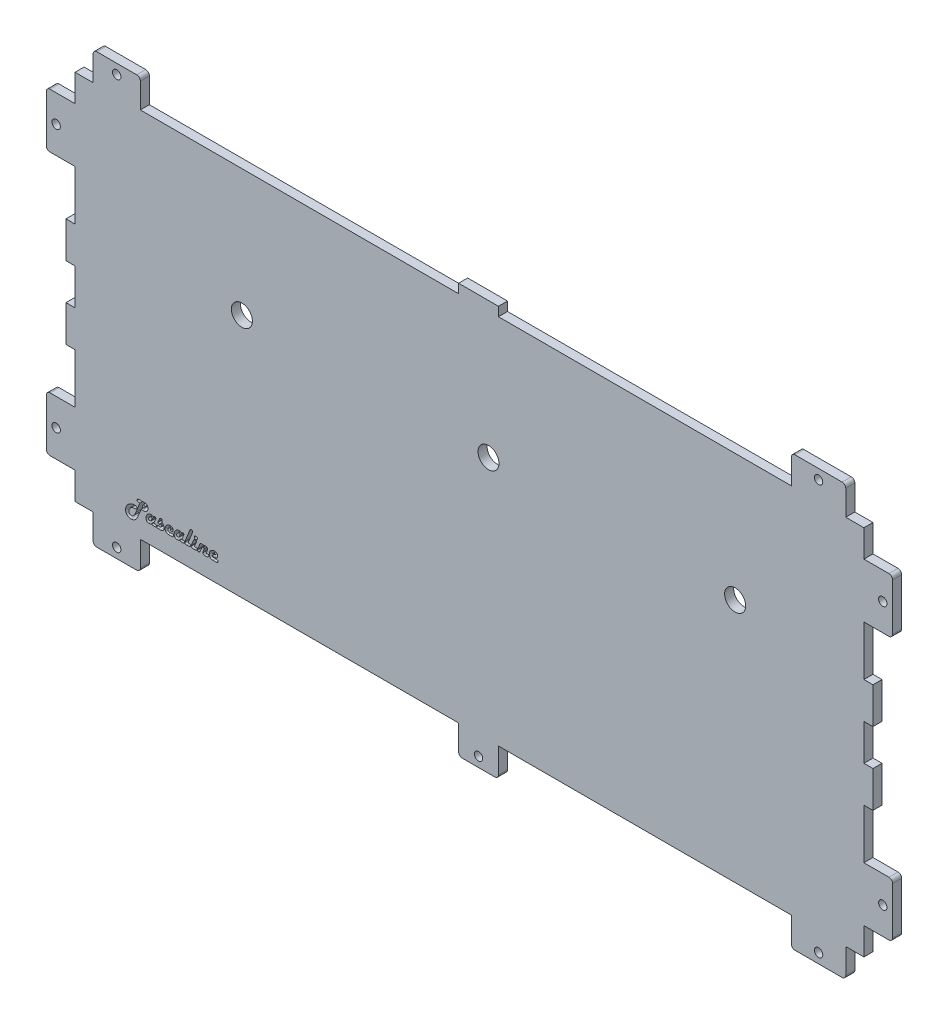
from build123d import *

# Parameters (mm, degrees)
SKETCH1_W             = 276.225
SKETCH1_H             = 130.175
SKETCH1_R             = 3.683
BOSS_EXTRUDE1_DEPTH   = 3.175
SKETCH2_W             = 10.033
SKETCH2_H             = 19.05
SKETCH2_W_2           = 3.175
SKETCH2_H_2           = 12.7
SKETCH2_W_3           = 16.51
SKETCH2_H_3           = 10.033
SKETCH2_W_4           = 13.97
SKETCH2_W_5           = 19.05
SKETCH2_H_4           = 3.175
BOSS_EXTRUDE2_DEPTH   = 3.175
F_4_CLEARANCE_HOLE1_D = 2.9464
FILLET1_R             = 1.27
CUT_EXTRUDE1_DEPTH    = 319.76638225


with BuildPart() as part:
    # Sketch1 → Boss-Extrude1 (new body)
    with BuildSketch(Plane.XY):
        with Locations((138.1125, 65.0875)):
            Rectangle(SKETCH1_W, SKETCH1_H)
        with Locations((58.42, 85.725)):
            Circle(SKETCH1_R, mode=Mode.SUBTRACT)
        with Locations((231.14, 85.725)):
            Circle(SKETCH1_R, mode=Mode.SUBTRACT)
        with Locations(Location((144.78, 85.725, 0), (0, 0, 180))):
            Circle(SKETCH1_R, mode=Mode.SUBTRACT)
    extrude(amount=BOSS_EXTRUDE1_DEPTH)

    # Sketch2 → Boss-Extrude2 (add)
    with BuildSketch(Plane.XY):
        with Locations((281.2415, 19.05)):
            Rectangle(SKETCH2_W, SKETCH2_H)
        with Locations((281.2415, 111.125)):
            Rectangle(SKETCH2_W, SKETCH2_H)
        with Locations((-1.5875, 77.7875)):
            Rectangle(SKETCH2_W_2, SKETCH2_H_2)
        with Locations((277.8125, 77.7875)):
            Rectangle(SKETCH2_W_2, SKETCH2_H_2)
        with Locations((-5.0165, 19.05)):
            Rectangle(SKETCH2_W, SKETCH2_H)
        with Locations((-5.0165, 111.125)):
            Rectangle(SKETCH2_W, SKETCH2_H)
        with Locations((277.8125, 52.3875)):
            Rectangle(SKETCH2_W_2, SKETCH2_H_2)
        with Locations((14.605, -5.0165)):
            Rectangle(SKETCH2_W_3, SKETCH2_H_3)
        with Locations((141.2875, -5.0165)):
            Rectangle(SKETCH2_W_4, SKETCH2_H_3)
        with Locations((260.35, -5.0165)):
            Rectangle(SKETCH2_W_5, SKETCH2_H_3)
        with Locations((14.605, 135.1915)):
            Rectangle(SKETCH2_W_3, SKETCH2_H_3)
        with Locations((260.35, 135.1915)):
            Rectangle(SKETCH2_W_5, SKETCH2_H_3)
        with Locations((141.2875, 131.7625)):
            Rectangle(SKETCH2_W_4, SKETCH2_H_4)
        with Locations((-1.5875, 52.3875)):
            Rectangle(SKETCH2_W_2, SKETCH2_H_2)
    extrude(amount=BOSS_EXTRUDE2_DEPTH)

    # 4 Clearance Hole1 (through all)
    with Locations(Plane.XY.offset(3.175)):
        with Locations((14.605, -6.604), (141.2875, -6.604), (260.35, -6.604), (282.829, 111.125), (-6.604, 111.125), (260.35, 136.779), (14.605, 136.779), (282.829, 19.05), (-6.604, 19.05)):
            Hole(F_4_CLEARANCE_HOLE1_D / 2)

    # Fillet1
    fillet1_edges = [part.edges().sort_by_distance(p)[0] for p in [
        (22.86, -10.033, 1.5875),
        (134.3025, -10.033, 1.5875),
        (148.2725, -10.033, 1.5875),
        (250.825, -10.033, 1.5875),
        (269.875, -10.033, 1.5875),
        (286.258, 9.525, 1.5875),
        (286.258, 28.575, 1.5875),
        (286.258, 101.6, 1.5875),
        (286.258, 120.65, 1.5875),
        (269.875, 140.208, 1.5875),
        (250.825, 140.208, 1.5875),
        (22.86, 140.208, 1.5875),
        (6.35, 140.208, 1.5875),
        (-10.033, 120.65, 1.5875),
        (-10.033, 101.6, 1.5875),
        (-10.033, 28.575, 1.5875),
        (-10.033, 9.525, 1.5875),
        (6.35, -10.033, 1.5875),
    ]]
    fillet(fillet1_edges, radius=FILLET1_R)

    # Sketch5 → Cut-Extrude1 (cut, through all)
    # profile 1 of 10: a face of its own
    with BuildSketch(Plane.XY.offset(3.175)):
        with BuildLine():
            Line((23.119201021, 9.164609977), (22.451206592, 7.500566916))
            add(Edge.make_bspline(
                [(22.451206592, 7.500566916), (22.411003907, 7.401430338), (22.333829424, 7.211124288), (22.219435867, 6.938643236), (22.112680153, 6.690113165), (22.012786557, 6.465475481), (21.920717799, 6.264069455), (21.833533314, 6.087517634), (21.755963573, 5.933870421), (21.661354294, 5.762755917), (21.539114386, 5.572432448), (21.375027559, 5.364837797), (21.194459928, 5.172753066), (21.060129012, 5.059889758), (20.992791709, 5.003313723)],
                knots=[0, 0, 0, 0, 1.315970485, 2.526183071, 3.635244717, 4.643279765, 5.550454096, 6.359128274, 7.065363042, 7.667512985, 8.763908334, 9.843272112, 10.918877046, 12, 12, 12, 12], degree=3))
            add(Edge.make_bspline(
                [(20.992791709, 5.003313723), (20.941866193, 4.965231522), (20.841070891, 4.889856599), (20.680401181, 4.792052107), (20.514563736, 4.708473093), (20.341573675, 4.641675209), (20.163005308, 4.589417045), (19.978244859, 4.551262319), (19.787353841, 4.528037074), (19.658056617, 4.52556047), (19.592618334, 4.524307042)],
                knots=[0, 0, 0, 0, 1.011044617, 2.001129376, 2.987597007, 3.961339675, 4.946518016, 5.943976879, 6.959431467, 8, 8, 8, 8], degree=3))
            add(Edge.make_bspline(
                [(19.592618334, 4.524307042), (19.523985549, 4.52577862), (19.389812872, 4.52865546), (19.193870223, 4.554855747), (19.007122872, 4.594062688), (18.83078106, 4.653339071), (18.663334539, 4.726507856), (18.506601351, 4.817898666), (18.35966799, 4.925082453), (18.22480845, 5.048815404), (18.102569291, 5.184697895), (17.996369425, 5.332046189), (17.904994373, 5.488467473), (17.831448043, 5.655681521), (17.774055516, 5.832504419), (17.734367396, 6.018966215), (17.708307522, 6.214954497), (17.70541107, 6.3491208), (17.70392946, 6.417750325)],
                knots=[0, 0, 0, 0, 1.095039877, 2.140732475, 3.150521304, 4.13652018, 5.104897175, 6.062745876, 7.026672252, 8.00261995, 8.979018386, 9.939223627, 10.897072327, 11.865449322, 12.849478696, 13.859267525, 14.904960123, 16, 16, 16, 16], degree=3))
            add(Edge.make_bspline(
                [(17.70392946, 6.417750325), (17.706469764, 6.510196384), (17.711485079, 6.692712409), (17.750571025, 6.961954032), (17.814671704, 7.222484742), (17.905671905, 7.473969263), (18.021297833, 7.716830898), (18.16431112, 7.949570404), (18.332042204, 8.17426002), (18.460931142, 8.313119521), (18.526442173, 8.383698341)],
                knots=[0, 0, 0, 0, 1.01377589, 2.001495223, 2.977585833, 3.952291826, 4.930103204, 5.92294397, 6.944284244, 8, 8, 8, 8], degree=3))
            add(Edge.make_bspline(
                [(18.526442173, 8.383698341), (18.564038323, 8.421013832), (18.639923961, 8.496332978), (18.762383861, 8.601213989), (18.891389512, 8.701406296), (19.026342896, 8.796968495), (19.169837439, 8.884085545), (19.318539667, 8.968473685), (19.475608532, 9.044630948), (19.690708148, 9.141268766), (19.965425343, 9.241006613), (20.2978387, 9.328678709), (20.629749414, 9.381793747), (20.850767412, 9.389158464), (20.96069945, 9.392821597)],
                knots=[0, 0, 0, 0, 0.706155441, 1.425333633, 2.148189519, 2.883981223, 3.628821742, 4.385725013, 5.163077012, 5.955384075, 7.529784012, 9.053423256, 10.534403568, 12, 12, 12, 12], degree=3))
            add(Edge.make_bspline(
                [(20.96069945, 9.392821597), (21.010777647, 9.391629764), (21.10661754, 9.389348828), (21.242284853, 9.36101028), (21.363435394, 9.317754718), (21.467338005, 9.255678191), (21.552788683, 9.180085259), (21.616087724, 9.091135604), (21.653226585, 8.989078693), (21.657440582, 8.917283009), (21.659597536, 8.880534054)],
                knots=[0, 0, 0, 0, 1.238826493, 2.370872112, 3.417595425, 4.41258701, 5.350953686, 6.225146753, 7.091533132, 8, 8, 8, 8], degree=3))
            add(Edge.make_bspline(
                [(21.659597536, 8.880534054), (21.657158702, 8.841764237), (21.65240403, 8.766179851), (21.612518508, 8.658791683), (21.545055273, 8.564566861), (21.48423124, 8.515858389), (21.452780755, 8.490672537)],
                knots=[0, 0, 0, 0, 1.010937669, 1.970891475, 2.950802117, 4, 4, 4, 4], degree=3))
            add(Edge.make_bspline(
                [(21.452780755, 8.490672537), (21.428650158, 8.476261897), (21.374303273, 8.443806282), (21.271172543, 8.413087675), (21.142728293, 8.387298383), (21.04721528, 8.377274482), (20.995168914, 8.371812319)],
                knots=[0, 0, 0, 0, 0.704559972, 1.586808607, 2.68501851, 4, 4, 4, 4], degree=3))
            add(Edge.make_bspline(
                [(20.995168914, 8.371812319), (20.930899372, 8.36533971), (20.80556437, 8.352717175), (20.622961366, 8.323144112), (20.44919412, 8.289935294), (20.285218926, 8.246571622), (20.130183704, 8.19766871), (19.983692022, 8.144126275), (19.847574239, 8.080489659), (19.761927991, 8.032764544), (19.719798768, 8.009288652)],
                knots=[0, 0, 0, 0, 1.159710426, 2.261604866, 3.320677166, 4.335395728, 5.305245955, 6.239579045, 7.134052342, 8, 8, 8, 8], degree=3))
            add(Edge.make_bspline(
                [(19.719798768, 8.009288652), (19.654419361, 7.967339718), (19.52562533, 7.884702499), (19.354426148, 7.733222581), (19.203332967, 7.564964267), (19.075629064, 7.379109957), (18.973627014, 7.181271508), (18.89879096, 6.976254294), (18.852926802, 6.765270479), (18.847636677, 6.622412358), (18.844987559, 6.550873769)],
                knots=[0, 0, 0, 0, 1.047576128, 2.063670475, 3.075290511, 4.094745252, 5.099666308, 6.072755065, 7.034899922, 8, 8, 8, 8], degree=3))
            add(Edge.make_bspline(
                [(18.844987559, 6.550873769), (18.845636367, 6.515185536), (18.846908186, 6.445228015), (18.857899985, 6.343133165), (18.875018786, 6.246246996), (18.901788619, 6.15588907), (18.933862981, 6.070634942), (18.972695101, 5.990387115), (19.020918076, 5.917086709), (19.073977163, 5.848438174), (19.13513267, 5.788442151), (19.199905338, 5.73415304), (19.271326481, 5.690354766), (19.346543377, 5.652700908), (19.427352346, 5.624580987), (19.513023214, 5.604540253), (19.603256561, 5.590584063), (19.665464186, 5.589730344), (19.697215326, 5.589294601)],
                knots=[0, 0, 0, 0, 1.180906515, 2.314860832, 3.395146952, 4.432720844, 5.428859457, 6.408284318, 7.375873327, 8.328235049, 9.274073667, 10.205991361, 11.119268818, 12.040047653, 12.985704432, 13.943108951, 14.9501506, 16, 16, 16, 16], degree=3))
            add(Edge.make_bspline(
                [(19.697215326, 5.589294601), (19.73772721, 5.590178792), (19.817696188, 5.591924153), (19.934736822, 5.613557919), (20.047745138, 5.64535598), (20.156538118, 5.691126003), (20.261491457, 5.749525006), (20.361851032, 5.821430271), (20.457232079, 5.906838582), (20.550130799, 6.005691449), (20.640514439, 6.122252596), (20.735291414, 6.255321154), (20.829339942, 6.410668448), (20.926497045, 6.585296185), (21.026287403, 6.779583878), (21.128874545, 6.99369617), (21.231187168, 7.22917089), (21.299659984, 7.393110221), (21.335109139, 7.477983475)],
                knots=[0, 0, 0, 0, 0.731682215, 1.444313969, 2.14503258, 2.851587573, 3.573238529, 4.31284086, 5.079201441, 5.885132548, 6.76239785, 7.744387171, 8.838039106, 10.04403949, 11.357848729, 12.787140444, 14.336666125, 16, 16, 16, 16], degree=3))
            Line((21.335109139, 7.477983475), (22.730528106, 10.914232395))
            Line((22.730528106, 10.914232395), (22.293122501, 10.914232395))
            add(Edge.make_bspline(
                [(22.293122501, 10.914232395), (22.249482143, 10.915318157), (22.167784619, 10.917350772), (22.053469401, 10.933486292), (21.955911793, 10.96103767), (21.875553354, 11.001448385), (21.812083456, 11.0538411), (21.766552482, 11.118910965), (21.739607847, 11.196317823), (21.737016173, 11.251577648), (21.735668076, 11.280321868)],
                knots=[0, 0, 0, 0, 1.386647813, 2.595892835, 3.659749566, 4.594681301, 5.434731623, 6.248703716, 7.089037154, 8, 8, 8, 8], degree=3))
            add(Edge.make_bspline(
                [(21.735668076, 11.280321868), (21.737604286, 11.321461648), (21.741339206, 11.400819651), (21.780099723, 11.512122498), (21.841922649, 11.609323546), (21.930694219, 11.688476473), (22.040352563, 11.751577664), (22.17060237, 11.796320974), (22.320267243, 11.821779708), (22.426142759, 11.825246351), (22.482110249, 11.827078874)],
                knots=[0, 0, 0, 0, 0.942601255, 1.818263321, 2.674766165, 3.564433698, 4.523656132, 5.566505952, 6.713616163, 8, 8, 8, 8], degree=3))
            Line((22.482110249, 11.827078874), (24.009464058, 11.827078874))
            add(Edge.make_bspline(
                [(24.009464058, 11.827078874), (24.07248493, 11.826141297), (24.194705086, 11.824322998), (24.371659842, 11.811086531), (24.536158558, 11.790426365), (24.687661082, 11.7598162), (24.826003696, 11.719494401), (24.951704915, 11.670604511), (25.065549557, 11.614116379), (25.166457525, 11.546868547), (25.254881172, 11.47075861), (25.331318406, 11.384834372), (25.394973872, 11.289168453), (25.449869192, 11.185035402), (25.489653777, 11.069843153), (25.51766631, 10.945418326), (25.536143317, 10.81176616), (25.53815736, 10.719365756), (25.539195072, 10.671757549)],
                knots=[0, 0, 0, 0, 1.377685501, 2.671828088, 3.877302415, 5.000186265, 6.047243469, 7.023626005, 7.94558449, 8.820055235, 9.667510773, 10.489711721, 11.325757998, 12.174186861, 13.056345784, 13.980864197, 14.959664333, 16, 16, 16, 16], degree=3))
            add(Edge.make_bspline(
                [(25.539195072, 10.671757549), (25.537217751, 10.613032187), (25.533336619, 10.497764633), (25.507219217, 10.328808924), (25.461558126, 10.168586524), (25.398541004, 10.016101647), (25.315426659, 9.873155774), (25.215734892, 9.73744145), (25.098243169, 9.609536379), (25.007634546, 9.534438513), (24.961534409, 9.496229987)],
                knots=[0, 0, 0, 0, 1.037190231, 2.03582197, 3.010506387, 3.973515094, 4.942177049, 5.923321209, 6.943420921, 8, 8, 8, 8], degree=3))
            add(Edge.make_bspline(
                [(24.961534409, 9.496229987), (24.924861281, 9.469591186), (24.849567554, 9.414898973), (24.722279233, 9.347795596), (24.581294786, 9.290628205), (24.42582274, 9.24494617), (24.257052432, 9.208122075), (24.073914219, 9.182358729), (23.876613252, 9.166850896), (23.740077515, 9.16537344), (23.669523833, 9.164609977)],
                knots=[0, 0, 0, 0, 0.800437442, 1.643380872, 2.535600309, 3.486195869, 4.50417187, 5.586788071, 6.752993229, 8, 8, 8, 8], degree=3))
            Line((23.669523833, 9.164609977), (23.119201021, 9.164609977))
        make_face()
        with BuildLine():
            Line((23.509062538, 10.077456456), (23.833550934, 10.077456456))
            add(Edge.make_bspline(
                [(23.833550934, 10.077456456), (23.883581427, 10.078871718), (23.978009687, 10.081542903), (24.109812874, 10.105830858), (24.222265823, 10.147368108), (24.315221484, 10.206091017), (24.38842248, 10.283422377), (24.437974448, 10.379084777), (24.470358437, 10.489814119), (24.47287967, 10.569284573), (24.474207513, 10.611138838)],
                knots=[0, 0, 0, 0, 1.258971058, 2.376199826, 3.358208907, 4.260347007, 5.121448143, 6.005251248, 6.949436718, 8, 8, 8, 8], degree=3))
            add(Edge.make_bspline(
                [(24.474207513, 10.611138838), (24.473067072, 10.634992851), (24.470906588, 10.680182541), (24.45485612, 10.743618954), (24.424912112, 10.796445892), (24.384765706, 10.841296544), (24.331090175, 10.873849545), (24.267531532, 10.898068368), (24.192697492, 10.911946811), (24.139079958, 10.913437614), (24.110495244, 10.914232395)],
                knots=[0, 0, 0, 0, 1.057975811, 2.004258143, 2.869579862, 3.727735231, 4.644179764, 5.623179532, 6.73286349, 8, 8, 8, 8], degree=3))
            Line((24.110495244, 10.914232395), (23.84187115, 10.914232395))
            Line((23.84187115, 10.914232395), (23.509062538, 10.077456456))
        make_face(mode=Mode.SUBTRACT)
    # profile 2 of 10: a face of its own
    with BuildSketch(Plane.XY.offset(3.175)):
        with BuildLine():
            Line((27.590722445, 7.262846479), (28.032882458, 7.262846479))
            add(Edge.make_bspline(
                [(28.032882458, 7.262846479), (28.069771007, 7.26168404), (28.139217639, 7.259495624), (28.237100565, 7.244044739), (28.319497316, 7.213913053), (28.389453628, 7.175207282), (28.441730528, 7.120759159), (28.479643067, 7.055670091), (28.502815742, 6.978700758), (28.504866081, 6.923472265), (28.505946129, 6.894379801)],
                knots=[0, 0, 0, 0, 1.294214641, 2.436497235, 3.45633191, 4.35958604, 5.214514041, 6.067746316, 6.982155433, 8, 8, 8, 8], degree=3))
            add(Edge.make_bspline(
                [(28.505946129, 6.894379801), (28.504075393, 6.853751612), (28.500488, 6.775841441), (28.467922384, 6.66547908), (28.411237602, 6.570686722), (28.335484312, 6.489620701), (28.239850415, 6.426705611), (28.127852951, 6.380604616), (27.999107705, 6.355527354), (27.90818237, 6.351900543), (27.860535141, 6.35)],
                knots=[0, 0, 0, 0, 1.02006706, 1.956119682, 2.85821293, 3.77438774, 4.72208319, 5.713685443, 6.801912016, 8, 8, 8, 8], degree=3))
            Line((27.860535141, 6.35), (27.347058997, 6.35))
            add(Edge.make_bspline(
                [(27.347058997, 6.35), (27.319272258, 6.350924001), (27.266140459, 6.35269081), (27.189661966, 6.365809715), (27.119931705, 6.388489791), (27.056725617, 6.420297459), (27.001086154, 6.461923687), (26.951568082, 6.511009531), (26.909321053, 6.570088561), (26.888358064, 6.614676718), (26.877561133, 6.637641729)],
                knots=[0, 0, 0, 0, 1.135602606, 2.17141737, 3.159933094, 4.123316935, 5.049777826, 5.988893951, 6.964185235, 8, 8, 8, 8], degree=3))
            add(Edge.make_bspline(
                [(26.877561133, 6.637641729), (26.829418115, 6.593791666), (26.738706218, 6.511168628), (26.589078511, 6.421916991), (26.442765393, 6.360717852), (26.343224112, 6.353490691), (26.295146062, 6.35)],
                knots=[0, 0, 0, 0, 1.172355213, 2.208971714, 3.134940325, 4, 4, 4, 4], degree=3))
            Line((26.295146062, 6.35), (25.838722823, 6.35))
            add(Edge.make_bspline(
                [(25.838722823, 6.35), (25.802613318, 6.350846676), (25.732080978, 6.352500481), (25.629021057, 6.36739538), (25.530996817, 6.390336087), (25.439134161, 6.425910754), (25.351766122, 6.468220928), (25.269891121, 6.521254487), (25.194345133, 6.584489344), (25.123714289, 6.655720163), (25.061392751, 6.735720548), (25.004824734, 6.82093039), (24.958631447, 6.913392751), (24.9203783, 7.011259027), (24.891018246, 7.114802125), (24.869013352, 7.224008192), (24.857836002, 7.339477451), (24.855668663, 7.418533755), (24.854560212, 7.45896584)],
                knots=[0, 0, 0, 0, 1.038881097, 2.029236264, 2.991883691, 3.930308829, 4.858629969, 5.782385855, 6.730121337, 7.689859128, 8.664191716, 9.644845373, 10.629272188, 11.633194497, 12.665607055, 13.723595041, 14.835769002, 16, 16, 16, 16], degree=3))
            add(Edge.make_bspline(
                [(24.854560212, 7.45896584), (24.85610135, 7.520862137), (24.859147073, 7.643186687), (24.885247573, 7.824235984), (24.926425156, 8.000246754), (24.985151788, 8.171403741), (25.060821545, 8.33685869), (25.150817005, 8.498507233), (25.260719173, 8.653277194), (25.383466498, 8.802278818), (25.517065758, 8.939411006), (25.65634466, 9.060947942), (25.801550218, 9.162226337), (25.949498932, 9.247803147), (26.103529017, 9.312208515), (26.26118757, 9.359174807), (26.423717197, 9.387067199), (26.533554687, 9.390897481), (26.588730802, 9.392821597)],
                knots=[0, 0, 0, 0, 1.038393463, 2.052158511, 3.063456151, 4.068635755, 5.08344709, 6.113632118, 7.168837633, 8.264602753, 9.350863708, 10.378663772, 11.361961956, 12.31789787, 13.241700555, 14.156967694, 15.07416527, 16, 16, 16, 16], degree=3))
            add(Edge.make_bspline(
                [(26.588730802, 9.392821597), (26.629955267, 9.391802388), (26.709847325, 9.389827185), (26.825936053, 9.377663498), (26.93284671, 9.352720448), (27.032648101, 9.323430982), (27.12225627, 9.280706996), (27.204008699, 9.230733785), (27.277694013, 9.171469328), (27.318416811, 9.124076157), (27.338738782, 9.100425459)],
                knots=[0, 0, 0, 0, 1.187749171, 2.30183041, 3.353985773, 4.346587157, 5.291117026, 6.203238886, 7.103359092, 8, 8, 8, 8], degree=3))
            add(Edge.make_bspline(
                [(27.338738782, 9.100425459), (27.355674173, 9.123800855), (27.388572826, 9.169209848), (27.444893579, 9.229036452), (27.505129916, 9.279630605), (27.568893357, 9.321936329), (27.638154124, 9.352158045), (27.709275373, 9.377183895), (27.78560771, 9.389834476), (27.837518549, 9.391809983), (27.864100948, 9.392821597)],
                knots=[0, 0, 0, 0, 1.102961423, 2.142610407, 3.131917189, 4.106850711, 5.056016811, 6.014208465, 6.983119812, 8, 8, 8, 8], degree=3))
            add(Edge.make_bspline(
                [(27.864100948, 9.392821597), (27.892332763, 9.391374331), (27.947568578, 9.388542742), (28.026788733, 9.368747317), (28.097661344, 9.332619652), (28.159912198, 9.285477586), (28.212990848, 9.22913499), (28.25007614, 9.163329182), (28.274365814, 9.091402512), (28.276592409, 9.040801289), (28.277734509, 9.014846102)],
                knots=[0, 0, 0, 0, 1.085152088, 2.123110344, 3.11068521, 4.121931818, 5.11360817, 6.061884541, 7.005870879, 8, 8, 8, 8], degree=3))
            add(Edge.make_bspline(
                [(28.277734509, 9.014846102), (28.277038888, 8.995776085), (28.275563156, 8.955319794), (28.262690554, 8.892397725), (28.242496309, 8.824341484), (28.223506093, 8.778549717), (28.213549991, 8.754542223)],
                knots=[0, 0, 0, 0, 0.847236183, 1.797378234, 2.845219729, 4, 4, 4, 4], degree=3))
            Line((28.213549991, 8.754542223), (28.16957171, 8.648756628))
            Line((28.16957171, 8.648756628), (27.590722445, 7.262846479))
        make_face()
        with BuildLine():
            Line((26.134684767, 7.262846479), (26.235715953, 7.262846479))
            add(Edge.make_bspline(
                [(26.235715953, 7.262846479), (26.261118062, 7.263403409), (26.310245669, 7.264480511), (26.380704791, 7.276313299), (26.444219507, 7.296625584), (26.501442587, 7.324150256), (26.551533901, 7.360081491), (26.595304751, 7.403527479), (26.631459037, 7.455722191), (26.649532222, 7.494711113), (26.658858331, 7.514830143)],
                knots=[0, 0, 0, 0, 1.157664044, 2.238919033, 3.244614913, 4.190073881, 5.122668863, 6.042574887, 6.989931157, 8, 8, 8, 8], degree=3))
            Line((26.658858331, 7.514830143), (26.92985963, 8.166184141))
            add(Edge.make_bspline(
                [(26.92985963, 8.166184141), (26.946051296, 8.204845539), (26.974847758, 8.27360384), (26.981585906, 8.347699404), (26.98453533, 8.380132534)],
                knots=[0, 0, 0, 0, 1.124559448, 2, 2, 2, 2], degree=3))
            add(Edge.make_bspline(
                [(26.98453533, 8.380132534), (26.982919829, 8.396510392), (26.979660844, 8.429549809), (26.960273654, 8.478036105), (26.923140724, 8.519372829), (26.877468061, 8.558290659), (26.822149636, 8.591249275), (26.759781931, 8.614843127), (26.692035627, 8.629673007), (26.645070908, 8.631284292), (26.620823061, 8.632116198)],
                knots=[0, 0, 0, 0, 0.81058345, 1.635208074, 2.524363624, 3.523748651, 4.593951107, 5.683817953, 6.804157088, 8, 8, 8, 8], degree=3))
            add(Edge.make_bspline(
                [(26.620823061, 8.632116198), (26.596174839, 8.63128371), (26.546394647, 8.629602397), (26.472572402, 8.613117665), (26.399545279, 8.588130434), (26.327079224, 8.552743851), (26.255132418, 8.507577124), (26.183183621, 8.452598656), (26.113420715, 8.386315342), (26.021876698, 8.289084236), (25.923002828, 8.158030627), (25.834330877, 7.992365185), (25.778103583, 7.822683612), (25.770947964, 7.707389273), (25.767406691, 7.650330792)],
                knots=[0, 0, 0, 0, 0.627706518, 1.267732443, 1.919531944, 2.592823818, 3.31892668, 4.082778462, 4.897707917, 5.769757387, 7.487317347, 9.064628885, 10.547302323, 12, 12, 12, 12], degree=3))
            add(Edge.make_bspline(
                [(25.767406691, 7.650330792), (25.768547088, 7.620143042), (25.770712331, 7.562826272), (25.786711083, 7.482537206), (25.814989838, 7.413874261), (25.857126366, 7.358291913), (25.910530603, 7.314821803), (25.97542406, 7.283164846), (26.051786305, 7.265877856), (26.106072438, 7.263892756), (26.134684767, 7.262846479)],
                knots=[0, 0, 0, 0, 1.183693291, 2.247450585, 3.194323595, 4.070859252, 4.954393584, 5.871857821, 6.878330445, 8, 8, 8, 8], degree=3))
        make_face(mode=Mode.SUBTRACT)
    # profile 3 of 10: a face of its own
    with BuildSketch(Plane.XY.offset(3.175)):
        with BuildLine():
            Line((29.990510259, 8.330211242), (29.912062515, 8.16024113))
            add(Edge.make_bspline(
                [(29.912062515, 8.16024113), (29.896884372, 8.131312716), (29.86769618, 8.07568219), (29.814544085, 8.00141012), (29.757815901, 7.937540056), (29.695046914, 7.885850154), (29.628129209, 7.844607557), (29.555769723, 7.815808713), (29.478606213, 7.79887687), (29.425612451, 7.796534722), (29.39858637, 7.795340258)],
                knots=[0, 0, 0, 0, 1.174117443, 2.257875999, 3.277186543, 4.239058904, 5.172954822, 6.09414408, 7.028039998, 8, 8, 8, 8], degree=3))
            add(Edge.make_bspline(
                [(29.39858637, 7.795340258), (29.371134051, 7.796795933), (29.316667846, 7.799684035), (29.237096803, 7.82031378), (29.16263589, 7.855638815), (29.09462143, 7.902428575), (29.037107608, 7.958103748), (28.993789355, 8.019877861), (28.967174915, 8.086882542), (28.963967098, 8.133470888), (28.962369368, 8.156675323)],
                knots=[0, 0, 0, 0, 1.057292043, 2.097698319, 3.142574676, 4.21811325, 5.26521749, 6.20945791, 7.108177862, 8, 8, 8, 8], degree=3))
            add(Edge.make_bspline(
                [(28.962369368, 8.156675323), (28.963902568, 8.18098518), (28.967274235, 8.234445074), (28.992789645, 8.318434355), (29.027799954, 8.414397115), (29.061029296, 8.47951667), (29.078852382, 8.514444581)],
                knots=[0, 0, 0, 0, 0.768398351, 1.68978755, 2.760880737, 4, 4, 4, 4], degree=3))
            Line((29.078852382, 8.514444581), (29.612534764, 9.55209429))
            add(Edge.make_bspline(
                [(29.612534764, 9.55209429), (29.628998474, 9.581760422), (29.660355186, 9.638262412), (29.714608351, 9.714353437), (29.771846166, 9.778597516), (29.830813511, 9.833390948), (29.894697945, 9.874194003), (29.961322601, 9.90314064), (30.030689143, 9.921974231), (30.078349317, 9.92419981), (30.102238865, 9.925315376)],
                knots=[0, 0, 0, 0, 1.254889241, 2.390056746, 3.44940031, 4.435704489, 5.358962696, 6.23882182, 7.117213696, 8, 8, 8, 8], degree=3))
            add(Edge.make_bspline(
                [(30.102238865, 9.925315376), (30.127723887, 9.924333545), (30.177477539, 9.922416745), (30.249027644, 9.902648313), (30.314253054, 9.870016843), (30.371649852, 9.82561983), (30.422350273, 9.775108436), (30.456581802, 9.715249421), (30.480139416, 9.651678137), (30.482550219, 9.606987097), (30.483780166, 9.584186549)],
                knots=[0, 0, 0, 0, 1.076175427, 2.100985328, 3.113101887, 4.142426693, 5.162150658, 6.116677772, 7.039163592, 8, 8, 8, 8], degree=3))
            add(Edge.make_bspline(
                [(30.483780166, 9.584186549), (30.483189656, 9.576625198), (30.481707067, 9.55764097), (30.472108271, 9.524410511), (30.457923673, 9.48041725), (30.445526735, 9.447837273), (30.438613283, 9.429668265)],
                knots=[0, 0, 0, 0, 0.562304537, 1.411773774, 2.556613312, 4, 4, 4, 4], degree=3))
            add(Edge.make_bspline(
                [(30.438613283, 9.429668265), (30.429934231, 9.4021552), (30.4139082, 9.351351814), (30.409658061, 9.29828798), (30.407709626, 9.273961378)],
                knots=[0, 0, 0, 0, 1.083119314, 2, 2, 2, 2], degree=3))
            add(Edge.make_bspline(
                [(30.407709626, 9.273961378), (30.410360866, 9.231672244), (30.41576673, 9.145444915), (30.457407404, 9.016624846), (30.521341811, 8.886134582), (30.581783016, 8.805145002), (30.613337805, 8.762862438)],
                knots=[0, 0, 0, 0, 0.903479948, 1.84219102, 2.873463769, 4, 4, 4, 4], degree=3))
            Line((30.613337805, 8.762862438), (30.862944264, 8.449071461))
            add(Edge.make_bspline(
                [(30.862944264, 8.449071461), (30.89315876, 8.40941273), (30.95181765, 8.332418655), (31.029517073, 8.213642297), (31.096639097, 8.096689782), (31.150204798, 7.979553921), (31.192582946, 7.863611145), (31.222000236, 7.748525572), (31.241056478, 7.634323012), (31.243346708, 7.558484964), (31.244485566, 7.520773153)],
                knots=[0, 0, 0, 0, 1.169686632, 2.270847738, 3.328397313, 4.331060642, 5.289870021, 6.221237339, 7.115478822, 8, 8, 8, 8], degree=3))
            add(Edge.make_bspline(
                [(31.244485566, 7.520773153), (31.243374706, 7.479898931), (31.241185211, 7.399336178), (31.222953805, 7.281348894), (31.193158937, 7.168541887), (31.151222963, 7.060930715), (31.097710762, 6.958280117), (31.031457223, 6.861340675), (30.953690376, 6.769443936), (30.865170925, 6.683679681), (30.768195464, 6.604874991), (30.663003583, 6.537900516), (30.55370701, 6.478341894), (30.437152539, 6.432662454), (30.315721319, 6.395108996), (30.188203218, 6.369932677), (30.055210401, 6.351843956), (29.964426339, 6.35062387), (29.918005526, 6.35)],
                knots=[0, 0, 0, 0, 0.993241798, 1.957671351, 2.894532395, 3.824635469, 4.759513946, 5.702543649, 6.673110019, 7.681185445, 8.695042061, 9.70491044, 10.708882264, 11.715852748, 12.742665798, 13.794825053, 14.872423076, 16, 16, 16, 16], degree=3))
            Line((29.918005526, 6.35), (29.080040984, 6.35))
            add(Edge.make_bspline(
                [(29.080040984, 6.35), (29.041166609, 6.351148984), (28.968164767, 6.353306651), (28.865667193, 6.368799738), (28.778850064, 6.39860707), (28.70672086, 6.439016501), (28.649687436, 6.491477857), (28.609138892, 6.556610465), (28.58673032, 6.634252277), (28.583643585, 6.689400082), (28.582016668, 6.718466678)],
                knots=[0, 0, 0, 0, 1.323532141, 2.485449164, 3.513452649, 4.431917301, 5.281225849, 6.123328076, 7.010867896, 8, 8, 8, 8], degree=3))
            add(Edge.make_bspline(
                [(28.582016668, 6.718466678), (28.583766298, 6.759131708), (28.587126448, 6.837228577), (28.621444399, 6.947402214), (28.678777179, 7.042559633), (28.758030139, 7.122462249), (28.857096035, 7.185049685), (28.972704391, 7.232327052), (29.105937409, 7.257322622), (29.199599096, 7.26094353), (29.248822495, 7.262846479)],
                knots=[0, 0, 0, 0, 1.001377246, 1.923137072, 2.813709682, 3.719614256, 4.674449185, 5.687788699, 6.784829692, 8, 8, 8, 8], degree=3))
            Line((29.248822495, 7.262846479), (29.71356595, 7.262846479))
            add(Edge.make_bspline(
                [(29.71356595, 7.262846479), (29.761976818, 7.263714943), (29.852890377, 7.265345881), (29.979460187, 7.28416678), (30.087169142, 7.314282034), (30.176102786, 7.356875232), (30.246912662, 7.412505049), (30.297305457, 7.482368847), (30.326991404, 7.565690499), (30.330040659, 7.625120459), (30.331639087, 7.656273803)],
                knots=[0, 0, 0, 0, 1.402558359, 2.633945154, 3.698995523, 4.63394819, 5.475307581, 6.281836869, 7.099334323, 8, 8, 8, 8], degree=3))
            add(Edge.make_bspline(
                [(30.331639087, 7.656273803), (30.329759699, 7.681390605), (30.325750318, 7.734973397), (30.29981842, 7.817251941), (30.260510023, 7.906123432), (30.223911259, 7.964172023), (30.204458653, 7.995025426)],
                knots=[0, 0, 0, 0, 0.822745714, 1.755200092, 2.806866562, 4, 4, 4, 4], degree=3))
            Line((30.204458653, 7.995025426), (29.990510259, 8.330211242))
        make_face()
    # profile 4 of 10: a face of its own
    with BuildSketch(Plane.XY.offset(3.175)):
        with BuildLine():
            Line((33.843958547, 6.35), (32.680317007, 6.35))
            add(Edge.make_bspline(
                [(32.680317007, 6.35), (32.639473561, 6.351331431), (32.559475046, 6.353939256), (32.442122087, 6.368805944), (32.331089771, 6.397249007), (32.224677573, 6.432858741), (32.125228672, 6.482977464), (32.031435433, 6.542005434), (31.943344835, 6.612135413), (31.862148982, 6.692296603), (31.788904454, 6.781373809), (31.723642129, 6.876673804), (31.67087138, 6.979950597), (31.624984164, 7.087986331), (31.590247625, 7.203147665), (31.567630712, 7.324780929), (31.550914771, 7.452170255), (31.549492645, 7.539336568), (31.548767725, 7.583769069)],
                knots=[0, 0, 0, 0, 1.04308008, 2.043041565, 3.012085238, 3.965374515, 4.901770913, 5.84746328, 6.790555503, 7.770466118, 8.754752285, 9.731054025, 10.712842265, 11.710345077, 12.724731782, 13.776116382, 14.86638876, 16, 16, 16, 16], degree=3))
            add(Edge.make_bspline(
                [(31.548767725, 7.583769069), (31.550434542, 7.643669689), (31.553726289, 7.761965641), (31.577855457, 7.936444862), (31.618616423, 8.105181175), (31.675046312, 8.268099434), (31.750410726, 8.42377383), (31.839361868, 8.574392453), (31.946140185, 8.718148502), (32.065971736, 8.855189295), (32.19833574, 8.979735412), (32.336825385, 9.090917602), (32.481896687, 9.184309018), (32.632077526, 9.261377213), (32.789231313, 9.319248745), (32.951349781, 9.362816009), (33.119703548, 9.388030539), (33.233728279, 9.391214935), (33.29125853, 9.392821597)],
                knots=[0, 0, 0, 0, 1.033018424, 2.040077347, 3.031267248, 4.023304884, 5.007568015, 6.009629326, 7.036117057, 8.091719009, 9.145549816, 10.16692925, 11.15074152, 12.116516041, 13.072326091, 14.033738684, 15.007938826, 16, 16, 16, 16], degree=3))
            add(Edge.make_bspline(
                [(33.29125853, 9.392821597), (33.330123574, 9.39229061), (33.406065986, 9.391253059), (33.516835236, 9.378681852), (33.62234278, 9.360223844), (33.721984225, 9.332564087), (33.816684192, 9.298575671), (33.904919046, 9.254933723), (33.988753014, 9.205465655), (34.065535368, 9.147041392), (34.135215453, 9.083436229), (34.197063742, 9.015218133), (34.248354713, 8.941154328), (34.289538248, 8.862143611), (34.324343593, 8.779529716), (34.345526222, 8.691155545), (34.361010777, 8.598583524), (34.362575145, 8.535117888), (34.363377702, 8.502558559)],
                knots=[0, 0, 0, 0, 1.192851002, 2.330834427, 3.419016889, 4.478598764, 5.502444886, 6.503631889, 7.49680333, 8.487139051, 9.460210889, 10.390750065, 11.308717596, 12.217610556, 13.123567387, 14.053072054, 15.001181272, 16, 16, 16, 16], degree=3))
            add(Edge.make_bspline(
                [(34.363377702, 8.502558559), (34.361783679, 8.458384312), (34.358716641, 8.37338923), (34.328641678, 8.252278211), (34.283123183, 8.141976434), (34.216010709, 8.047284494), (34.135293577, 7.969033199), (34.041830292, 7.91161127), (33.936681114, 7.87676091), (33.862847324, 7.873225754), (33.824940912, 7.871410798)],
                knots=[0, 0, 0, 0, 1.140049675, 2.193554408, 3.207776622, 4.208142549, 5.171800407, 6.095933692, 7.022448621, 8, 8, 8, 8], degree=3))
            add(Edge.make_bspline(
                [(33.824940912, 7.871410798), (33.795542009, 7.87215502), (33.740311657, 7.873553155), (33.663568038, 7.888085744), (33.597715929, 7.909794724), (33.543778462, 7.942790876), (33.500419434, 7.984790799), (33.471820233, 8.038507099), (33.453420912, 8.100004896), (33.451523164, 8.144247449), (33.450531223, 8.167372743)],
                knots=[0, 0, 0, 0, 1.293872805, 2.430738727, 3.43019671, 4.33150824, 5.195698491, 6.055468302, 6.983605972, 8, 8, 8, 8], degree=3))
            add(Edge.make_bspline(
                [(33.450531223, 8.167372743), (33.450531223, 8.181239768), (33.450531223, 8.206596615), (33.450531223, 8.231953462), (33.450531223, 8.243443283)],
                knots=[0, 0, 0, 0, 1.09375, 2, 2, 2, 2], degree=3))
            add(Edge.make_bspline(
                [(33.450531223, 8.243443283), (33.450531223, 8.255725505), (33.450531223, 8.279497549), (33.450531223, 8.303269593), (33.450531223, 8.314759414)],
                knots=[0, 0, 0, 0, 1.033333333, 2, 2, 2, 2], degree=3))
            add(Edge.make_bspline(
                [(33.450531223, 8.314759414), (33.44967953, 8.333876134), (33.448077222, 8.369840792), (33.434613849, 8.419916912), (33.413511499, 8.463087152), (33.380914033, 8.497551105), (33.339478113, 8.523737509), (33.289753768, 8.542520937), (33.231618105, 8.554749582), (33.189901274, 8.555594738), (33.167643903, 8.556045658)],
                knots=[0, 0, 0, 0, 1.076936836, 2.026062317, 2.906040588, 3.760364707, 4.665822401, 5.649858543, 6.746118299, 8, 8, 8, 8], degree=3))
            add(Edge.make_bspline(
                [(33.167643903, 8.556045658), (33.123621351, 8.553163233), (33.034942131, 8.547356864), (32.906677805, 8.495910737), (32.786484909, 8.413771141), (32.676556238, 8.304885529), (32.583034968, 8.177699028), (32.511892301, 8.039385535), (32.470278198, 7.891609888), (32.464516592, 7.790439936), (32.461614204, 7.739475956)],
                knots=[0, 0, 0, 0, 0.889989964, 1.79279967, 2.759962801, 3.828151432, 4.914528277, 5.949409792, 6.967022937, 8, 8, 8, 8], degree=3))
            add(Edge.make_bspline(
                [(32.461614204, 7.739475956), (32.463855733, 7.699247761), (32.468094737, 7.623171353), (32.500732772, 7.517048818), (32.560782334, 7.431656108), (32.643809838, 7.363978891), (32.755272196, 7.317078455), (32.894754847, 7.2858988), (33.064490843, 7.266324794), (33.187790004, 7.264066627), (33.254411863, 7.262846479)],
                knots=[0, 0, 0, 0, 0.913027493, 1.726645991, 2.482782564, 3.249916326, 4.127695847, 5.201188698, 6.487726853, 8, 8, 8, 8], degree=3))
            Line((33.254411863, 7.262846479), (34.012740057, 7.262846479))
            add(Edge.make_bspline(
                [(34.012740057, 7.262846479), (34.052054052, 7.261906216), (34.125991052, 7.260137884), (34.229054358, 7.242045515), (34.317391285, 7.214818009), (34.390470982, 7.173472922), (34.447565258, 7.119330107), (34.488145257, 7.052929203), (34.510965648, 6.974664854), (34.513940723, 6.919099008), (34.515518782, 6.889625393)],
                knots=[0, 0, 0, 0, 1.322009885, 2.486276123, 3.511116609, 4.419281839, 5.287086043, 6.131096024, 7.008683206, 8, 8, 8, 8], degree=3))
            add(Edge.make_bspline(
                [(34.515518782, 6.889625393), (34.513867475, 6.849711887), (34.510676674, 6.772587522), (34.474586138, 6.664416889), (34.416987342, 6.569236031), (34.336227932, 6.489587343), (34.236195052, 6.426608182), (34.119790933, 6.380845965), (33.986884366, 6.355420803), (33.893195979, 6.351867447), (33.843958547, 6.35)],
                knots=[0, 0, 0, 0, 0.982987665, 1.899414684, 2.782606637, 3.710260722, 4.674394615, 5.685217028, 6.783478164, 8, 8, 8, 8], degree=3))
        make_face()
    # profile 5 of 10: a face of its own
    with BuildSketch(Plane.XY.offset(3.175)):
        with BuildLine():
            Line((37.403822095, 7.262846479), (37.845982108, 7.262846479))
            add(Edge.make_bspline(
                [(37.845982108, 7.262846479), (37.882870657, 7.26168404), (37.952317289, 7.259495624), (38.050200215, 7.244044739), (38.132596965, 7.213913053), (38.202553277, 7.175207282), (38.254830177, 7.120759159), (38.292742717, 7.055670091), (38.315915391, 6.978700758), (38.31796573, 6.923472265), (38.319045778, 6.894379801)],
                knots=[0, 0, 0, 0, 1.294214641, 2.436497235, 3.45633191, 4.35958604, 5.214514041, 6.067746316, 6.982155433, 8, 8, 8, 8], degree=3))
            add(Edge.make_bspline(
                [(38.319045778, 6.894379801), (38.317175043, 6.853751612), (38.313587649, 6.775841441), (38.281022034, 6.66547908), (38.224337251, 6.570686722), (38.148583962, 6.489620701), (38.052950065, 6.426705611), (37.9409526, 6.380604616), (37.812207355, 6.355527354), (37.721282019, 6.351900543), (37.673634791, 6.35)],
                knots=[0, 0, 0, 0, 1.02006706, 1.956119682, 2.85821293, 3.77438774, 4.72208319, 5.713685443, 6.801912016, 8, 8, 8, 8], degree=3))
            Line((37.673634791, 6.35), (37.160158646, 6.35))
            add(Edge.make_bspline(
                [(37.160158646, 6.35), (37.132371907, 6.350924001), (37.079240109, 6.35269081), (37.002761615, 6.365809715), (36.933031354, 6.388489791), (36.869825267, 6.420297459), (36.814185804, 6.461923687), (36.764667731, 6.511009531), (36.722420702, 6.570088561), (36.701457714, 6.614676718), (36.690660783, 6.637641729)],
                knots=[0, 0, 0, 0, 1.135602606, 2.17141737, 3.159933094, 4.123316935, 5.049777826, 5.988893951, 6.964185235, 8, 8, 8, 8], degree=3))
            add(Edge.make_bspline(
                [(36.690660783, 6.637641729), (36.642517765, 6.593791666), (36.551805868, 6.511168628), (36.402178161, 6.421916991), (36.255865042, 6.360717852), (36.156323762, 6.353490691), (36.108245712, 6.35)],
                knots=[0, 0, 0, 0, 1.172355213, 2.208971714, 3.134940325, 4, 4, 4, 4], degree=3))
            Line((36.108245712, 6.35), (35.651822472, 6.35))
            add(Edge.make_bspline(
                [(35.651822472, 6.35), (35.615712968, 6.350846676), (35.545180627, 6.352500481), (35.442120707, 6.36739538), (35.344096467, 6.390336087), (35.252233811, 6.425910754), (35.164865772, 6.468220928), (35.082990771, 6.521254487), (35.007444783, 6.584489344), (34.936813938, 6.655720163), (34.8744924, 6.735720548), (34.817924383, 6.82093039), (34.771731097, 6.913392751), (34.733477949, 7.011259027), (34.704117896, 7.114802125), (34.682113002, 7.224008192), (34.670935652, 7.339477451), (34.668768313, 7.418533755), (34.667659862, 7.45896584)],
                knots=[0, 0, 0, 0, 1.038881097, 2.029236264, 2.991883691, 3.930308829, 4.858629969, 5.782385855, 6.730121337, 7.689859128, 8.664191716, 9.644845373, 10.629272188, 11.633194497, 12.665607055, 13.723595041, 14.835769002, 16, 16, 16, 16], degree=3))
            add(Edge.make_bspline(
                [(34.667659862, 7.45896584), (34.669201, 7.520862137), (34.672246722, 7.643186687), (34.698347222, 7.824235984), (34.739524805, 8.000246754), (34.798251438, 8.171403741), (34.873921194, 8.33685869), (34.963916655, 8.498507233), (35.073818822, 8.653277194), (35.196566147, 8.802278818), (35.330165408, 8.939411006), (35.46944431, 9.060947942), (35.614649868, 9.162226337), (35.762598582, 9.247803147), (35.916628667, 9.312208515), (36.07428722, 9.359174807), (36.236816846, 9.387067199), (36.346654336, 9.390897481), (36.401830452, 9.392821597)],
                knots=[0, 0, 0, 0, 1.038393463, 2.052158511, 3.063456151, 4.068635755, 5.08344709, 6.113632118, 7.168837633, 8.264602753, 9.350863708, 10.378663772, 11.361961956, 12.31789787, 13.241700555, 14.156967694, 15.07416527, 16, 16, 16, 16], degree=3))
            add(Edge.make_bspline(
                [(36.401830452, 9.392821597), (36.443054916, 9.391802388), (36.522946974, 9.389827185), (36.639035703, 9.377663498), (36.74594636, 9.352720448), (36.845747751, 9.323430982), (36.935355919, 9.280706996), (37.017108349, 9.230733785), (37.090793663, 9.171469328), (37.131516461, 9.124076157), (37.151838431, 9.100425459)],
                knots=[0, 0, 0, 0, 1.187749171, 2.30183041, 3.353985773, 4.346587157, 5.291117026, 6.203238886, 7.103359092, 8, 8, 8, 8], degree=3))
            add(Edge.make_bspline(
                [(37.151838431, 9.100425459), (37.168773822, 9.123800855), (37.201672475, 9.169209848), (37.257993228, 9.229036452), (37.318229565, 9.279630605), (37.381993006, 9.321936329), (37.451253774, 9.352158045), (37.522375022, 9.377183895), (37.598707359, 9.389834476), (37.650618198, 9.391809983), (37.677200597, 9.392821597)],
                knots=[0, 0, 0, 0, 1.102961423, 2.142610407, 3.131917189, 4.106850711, 5.056016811, 6.014208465, 6.983119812, 8, 8, 8, 8], degree=3))
            add(Edge.make_bspline(
                [(37.677200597, 9.392821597), (37.705432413, 9.391374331), (37.760668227, 9.388542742), (37.839888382, 9.368747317), (37.910760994, 9.332619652), (37.973011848, 9.285477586), (38.026090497, 9.22913499), (38.06317579, 9.163329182), (38.087465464, 9.091402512), (38.089692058, 9.040801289), (38.090834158, 9.014846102)],
                knots=[0, 0, 0, 0, 1.085152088, 2.123110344, 3.11068521, 4.121931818, 5.11360817, 6.061884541, 7.005870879, 8, 8, 8, 8], degree=3))
            add(Edge.make_bspline(
                [(38.090834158, 9.014846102), (38.090138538, 8.995776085), (38.088662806, 8.955319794), (38.075790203, 8.892397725), (38.055595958, 8.824341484), (38.036605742, 8.778549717), (38.02664964, 8.754542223)],
                knots=[0, 0, 0, 0, 0.847236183, 1.797378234, 2.845219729, 4, 4, 4, 4], degree=3))
            Line((38.02664964, 8.754542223), (37.982671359, 8.648756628))
            Line((37.982671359, 8.648756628), (37.403822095, 7.262846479))
        make_face()
        with BuildLine():
            Line((35.947784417, 7.262846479), (36.048815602, 7.262846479))
            add(Edge.make_bspline(
                [(36.048815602, 7.262846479), (36.074217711, 7.263403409), (36.123345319, 7.264480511), (36.19380444, 7.276313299), (36.257319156, 7.296625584), (36.314542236, 7.324150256), (36.364633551, 7.360081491), (36.4084044, 7.403527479), (36.444558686, 7.455722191), (36.462631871, 7.494711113), (36.471957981, 7.514830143)],
                knots=[0, 0, 0, 0, 1.157664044, 2.238919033, 3.244614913, 4.190073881, 5.122668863, 6.042574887, 6.989931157, 8, 8, 8, 8], degree=3))
            Line((36.471957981, 7.514830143), (36.742959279, 8.166184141))
            add(Edge.make_bspline(
                [(36.742959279, 8.166184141), (36.759150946, 8.204845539), (36.787947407, 8.27360384), (36.794685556, 8.347699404), (36.79763498, 8.380132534)],
                knots=[0, 0, 0, 0, 1.124559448, 2, 2, 2, 2], degree=3))
            add(Edge.make_bspline(
                [(36.79763498, 8.380132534), (36.796019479, 8.396510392), (36.792760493, 8.429549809), (36.773373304, 8.478036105), (36.736240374, 8.519372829), (36.69056771, 8.558290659), (36.635249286, 8.591249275), (36.572881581, 8.614843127), (36.505135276, 8.629673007), (36.458170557, 8.631284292), (36.433922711, 8.632116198)],
                knots=[0, 0, 0, 0, 0.81058345, 1.635208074, 2.524363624, 3.523748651, 4.593951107, 5.683817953, 6.804157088, 8, 8, 8, 8], degree=3))
            add(Edge.make_bspline(
                [(36.433922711, 8.632116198), (36.409274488, 8.63128371), (36.359494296, 8.629602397), (36.285672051, 8.613117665), (36.212644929, 8.588130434), (36.140178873, 8.552743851), (36.068232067, 8.507577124), (35.99628327, 8.452598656), (35.926520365, 8.386315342), (35.834976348, 8.289084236), (35.736102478, 8.158030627), (35.647430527, 7.992365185), (35.591203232, 7.822683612), (35.584047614, 7.707389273), (35.580506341, 7.650330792)],
                knots=[0, 0, 0, 0, 0.627706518, 1.267732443, 1.919531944, 2.592823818, 3.31892668, 4.082778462, 4.897707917, 5.769757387, 7.487317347, 9.064628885, 10.547302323, 12, 12, 12, 12], degree=3))
            add(Edge.make_bspline(
                [(35.580506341, 7.650330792), (35.581646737, 7.620143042), (35.58381198, 7.562826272), (35.599810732, 7.482537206), (35.628089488, 7.413874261), (35.670226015, 7.358291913), (35.723630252, 7.314821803), (35.788523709, 7.283164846), (35.864885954, 7.265877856), (35.919172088, 7.263892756), (35.947784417, 7.262846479)],
                knots=[0, 0, 0, 0, 1.183693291, 2.247450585, 3.194323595, 4.070859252, 4.954393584, 5.871857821, 6.878330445, 8, 8, 8, 8], degree=3))
        make_face(mode=Mode.SUBTRACT)
    # profile 6 of 10: a face of its own
    with BuildSketch(Plane.XY.offset(3.175)):
        with BuildLine():
            Line((39.54330603, 7.262846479), (39.964071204, 7.262846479))
            add(Edge.make_bspline(
                [(39.964071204, 7.262846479), (40.002196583, 7.261905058), (40.073773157, 7.260137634), (40.173354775, 7.242145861), (40.258430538, 7.21455385), (40.328942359, 7.173454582), (40.383609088, 7.11886309), (40.42260496, 7.052624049), (40.445990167, 6.974752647), (40.447970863, 6.919118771), (40.449020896, 6.889625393)],
                knots=[0, 0, 0, 0, 1.309452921, 2.458366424, 3.466370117, 4.370442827, 5.237320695, 6.092345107, 6.988688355, 8, 8, 8, 8], degree=3))
            add(Edge.make_bspline(
                [(40.449020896, 6.889625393), (40.447172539, 6.849379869), (40.443628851, 6.772220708), (40.410674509, 6.662826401), (40.354637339, 6.568445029), (40.278306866, 6.487978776), (40.181022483, 6.426596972), (40.067670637, 6.380781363), (39.936642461, 6.355345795), (39.844129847, 6.351847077), (39.795289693, 6.35)],
                knots=[0, 0, 0, 0, 1.005849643, 1.928425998, 2.826684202, 3.731762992, 4.678240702, 5.683992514, 6.777310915, 8, 8, 8, 8], degree=3))
            Line((39.795289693, 6.35), (39.073808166, 6.35))
            add(Edge.make_bspline(
                [(39.073808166, 6.35), (39.024104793, 6.3511204), (38.929397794, 6.353255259), (38.796033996, 6.382209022), (38.676940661, 6.423380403), (38.576584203, 6.485782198), (38.495272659, 6.562202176), (38.435788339, 6.652638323), (38.402076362, 6.756603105), (38.397478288, 6.829563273), (38.395116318, 6.867041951)],
                knots=[0, 0, 0, 0, 1.241664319, 2.36592195, 3.401368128, 4.381172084, 5.300106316, 6.174896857, 7.062468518, 8, 8, 8, 8], degree=3))
            add(Edge.make_bspline(
                [(38.395116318, 6.867041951), (38.396820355, 6.891314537), (38.400783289, 6.947763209), (38.426103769, 7.040904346), (38.463269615, 7.154591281), (38.495268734, 7.23606788), (38.512787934, 7.280675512)],
                knots=[0, 0, 0, 0, 0.674710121, 1.569115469, 2.669114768, 4, 4, 4, 4], degree=3))
            Line((38.512787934, 7.280675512), (40.156624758, 11.269624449))
            Line((40.156624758, 11.269624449), (40.200603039, 11.377787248))
            add(Edge.make_bspline(
                [(40.200603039, 11.377787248), (40.216217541, 11.413587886), (40.246179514, 11.482284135), (40.305952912, 11.573107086), (40.370159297, 11.65166252), (40.441516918, 11.716981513), (40.521220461, 11.766228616), (40.607611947, 11.801209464), (40.700702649, 11.823225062), (40.765462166, 11.825777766), (40.798469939, 11.827078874)],
                knots=[0, 0, 0, 0, 1.172057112, 2.249008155, 3.255426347, 4.216793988, 5.142151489, 6.055552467, 7.008919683, 8, 8, 8, 8], degree=3))
            add(Edge.make_bspline(
                [(40.798469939, 11.827078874), (40.825920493, 11.825652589), (40.879616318, 11.822862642), (40.957619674, 11.802461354), (41.028264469, 11.765925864), (41.090955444, 11.717396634), (41.142843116, 11.659734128), (41.182670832, 11.595411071), (41.205959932, 11.523955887), (41.208462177, 11.474226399), (41.209726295, 11.449103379)],
                knots=[0, 0, 0, 0, 1.062046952, 2.077462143, 3.092414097, 4.119914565, 5.129756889, 6.079111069, 7.029579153, 8, 8, 8, 8], degree=3))
            add(Edge.make_bspline(
                [(41.209726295, 11.449103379), (41.20909523, 11.428441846), (41.207786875, 11.385605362), (41.194478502, 11.319713), (41.175877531, 11.249663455), (41.158246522, 11.202532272), (41.149107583, 11.17810208)],
                knots=[0, 0, 0, 0, 0.886930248, 1.83882642, 2.879767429, 4, 4, 4, 4], degree=3))
            Line((41.149107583, 11.17810208), (41.105129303, 11.071127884))
            Line((41.105129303, 11.071127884), (39.54330603, 7.262846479))
        make_face()
    # profile 7 of 10: a face of its own
    with BuildSketch(Plane.XY.offset(3.175)):
        with BuildLine():
            Line((41.789764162, 7.262846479), (42.242621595, 7.262846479))
            add(Edge.make_bspline(
                [(42.242621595, 7.262846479), (42.280736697, 7.261862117), (42.352684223, 7.260003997), (42.452770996, 7.242389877), (42.538364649, 7.214203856), (42.609688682, 7.173848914), (42.66461192, 7.11885279), (42.703227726, 7.052418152), (42.728514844, 6.974996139), (42.730229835, 6.919162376), (42.731137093, 6.889625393)],
                knots=[0, 0, 0, 0, 1.304697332, 2.462796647, 3.467139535, 4.379611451, 5.243341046, 6.095260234, 6.992361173, 8, 8, 8, 8], degree=3))
            add(Edge.make_bspline(
                [(42.731137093, 6.889625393), (42.729430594, 6.849332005), (42.726153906, 6.77196377), (42.691223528, 6.663102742), (42.635735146, 6.567968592), (42.557990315, 6.488402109), (42.460572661, 6.426230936), (42.345779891, 6.38066451), (42.213189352, 6.355453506), (42.119508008, 6.351878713), (42.070274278, 6.35)],
                knots=[0, 0, 0, 0, 0.999806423, 1.919750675, 2.812612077, 3.719089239, 4.659880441, 5.668737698, 6.77481754, 8, 8, 8, 8], degree=3))
            Line((42.070274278, 6.35), (41.431994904, 6.35))
            add(Edge.make_bspline(
                [(41.431994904, 6.35), (41.376431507, 6.351856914), (41.270967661, 6.355381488), (41.121241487, 6.380775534), (40.990465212, 6.4260805), (40.877888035, 6.48709218), (40.788242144, 6.56634996), (40.723001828, 6.659858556), (40.684553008, 6.767566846), (40.679725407, 6.843357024), (40.677232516, 6.882493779)],
                knots=[0, 0, 0, 0, 1.286858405, 2.442561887, 3.501884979, 4.479685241, 5.389631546, 6.247460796, 7.095018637, 8, 8, 8, 8], degree=3))
            add(Edge.make_bspline(
                [(40.677232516, 6.882493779), (40.67872995, 6.905923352), (40.681953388, 6.956358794), (40.697945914, 7.036256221), (40.726401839, 7.124356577), (40.750186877, 7.185320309), (40.762811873, 7.217679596)],
                knots=[0, 0, 0, 0, 0.809405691, 1.742359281, 2.801653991, 4, 4, 4, 4], degree=3))
            Line((40.762811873, 7.217679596), (41.43556071, 8.831801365))
            Line((41.43556071, 8.831801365), (41.479538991, 8.94352997))
            add(Edge.make_bspline(
                [(41.479538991, 8.94352997), (41.495767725, 8.979199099), (41.526754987, 9.047305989), (41.584545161, 9.139675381), (41.65045709, 9.216928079), (41.721708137, 9.2831716), (41.802633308, 9.331930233), (41.890127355, 9.366968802), (41.984410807, 9.388962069), (42.049947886, 9.391518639), (42.083348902, 9.392821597)],
                knots=[0, 0, 0, 0, 1.169726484, 2.233484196, 3.241125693, 4.19639886, 5.12596356, 6.044540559, 7.003398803, 8, 8, 8, 8], degree=3))
            add(Edge.make_bspline(
                [(42.083348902, 9.392821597), (42.111217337, 9.391464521), (42.165352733, 9.388828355), (42.24365817, 9.367717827), (42.315487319, 9.333117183), (42.379270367, 9.28518985), (42.433485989, 9.229524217), (42.474563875, 9.166557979), (42.497800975, 9.09643038), (42.501195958, 9.047892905), (42.502925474, 9.023166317)],
                knots=[0, 0, 0, 0, 1.079075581, 2.096141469, 3.119681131, 4.151827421, 5.172944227, 6.118867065, 7.04168896, 8, 8, 8, 8], degree=3))
            add(Edge.make_bspline(
                [(42.502925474, 9.023166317), (42.501208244, 8.999685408), (42.497285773, 8.946050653), (42.473384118, 8.858863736), (42.439230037, 8.754470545), (42.407349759, 8.681382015), (42.390008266, 8.641625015)],
                knots=[0, 0, 0, 0, 0.704844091, 1.609994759, 2.699940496, 4, 4, 4, 4], degree=3))
            Line((42.390008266, 8.641625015), (41.789764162, 7.262846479))
        make_face()
    # profile 8 of 10: a face of its own
    with BuildSketch(Plane.XY.offset(3.175)):
        with BuildLine():
            add(Edge.make_bspline(
                [(42.312749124, 10.686020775), (42.35098851, 10.683948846), (42.425999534, 10.679884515), (42.534063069, 10.648189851), (42.632081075, 10.594152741), (42.719488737, 10.52223134), (42.791410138, 10.434823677), (42.845447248, 10.336805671), (42.877141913, 10.228742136), (42.881206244, 10.153731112), (42.883278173, 10.115491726)],
                knots=[0, 0, 0, 0, 1.022434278, 2.00562427, 2.98307932, 4, 5.01692068, 5.99437573, 6.977565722, 8, 8, 8, 8], degree=3))
            add(Edge.make_bspline(
                [(42.883278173, 10.115491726), (42.881206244, 10.07725234), (42.877141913, 10.002241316), (42.845447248, 9.89417778), (42.791410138, 9.796159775), (42.719488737, 9.708752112), (42.632081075, 9.636830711), (42.534063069, 9.582793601), (42.425999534, 9.551098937), (42.35098851, 9.547034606), (42.312749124, 9.544962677)],
                knots=[0, 0, 0, 0, 1.022434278, 2.00562427, 2.98307932, 4, 5.01692068, 5.99437573, 6.977565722, 8, 8, 8, 8], degree=3))
            add(Edge.make_bspline(
                [(42.312749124, 9.544962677), (42.274509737, 9.547034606), (42.199498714, 9.551098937), (42.091435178, 9.582793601), (41.993417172, 9.636830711), (41.90600951, 9.708752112), (41.834088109, 9.796159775), (41.780050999, 9.89417778), (41.748356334, 10.002241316), (41.744292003, 10.07725234), (41.742220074, 10.115491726)],
                knots=[0, 0, 0, 0, 1.022434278, 2.00562427, 2.98307932, 4, 5.01692068, 5.99437573, 6.977565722, 8, 8, 8, 8], degree=3))
            add(Edge.make_bspline(
                [(41.742220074, 10.115491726), (41.744292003, 10.153731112), (41.748356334, 10.228742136), (41.780050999, 10.336805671), (41.834088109, 10.434823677), (41.90600951, 10.52223134), (41.993417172, 10.594152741), (42.091435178, 10.648189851), (42.199498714, 10.679884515), (42.274509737, 10.683948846), (42.312749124, 10.686020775)],
                knots=[0, 0, 0, 0, 1.022434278, 2.00562427, 2.98307932, 4, 5.01692068, 5.99437573, 6.977565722, 8, 8, 8, 8], degree=3))
        make_face()
    # profile 9 of 10: a face of its own
    with BuildSketch(Plane.XY.offset(3.175)):
        with BuildLine():
            Line((45.852406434, 7.262846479), (46.33379032, 7.262846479))
            add(Edge.make_bspline(
                [(46.33379032, 7.262846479), (46.3734953, 7.26191626), (46.447818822, 7.260174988), (46.551356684, 7.242145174), (46.639762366, 7.214405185), (46.713691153, 7.174246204), (46.769847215, 7.118882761), (46.810128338, 7.052775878), (46.834785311, 6.974892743), (46.837506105, 6.919137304), (46.838946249, 6.889625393)],
                knots=[0, 0, 0, 0, 1.332122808, 2.493592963, 3.515972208, 4.433507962, 5.28966748, 6.131650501, 7.011063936, 8, 8, 8, 8], degree=3))
            add(Edge.make_bspline(
                [(46.838946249, 6.889625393), (46.837352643, 6.849299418), (46.834287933, 6.771747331), (46.797691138, 6.663020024), (46.741108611, 6.567530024), (46.660689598, 6.487937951), (46.560413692, 6.426872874), (46.443757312, 6.380359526), (46.309453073, 6.355613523), (46.214624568, 6.351928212), (46.165008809, 6.35)],
                knots=[0, 0, 0, 0, 0.989273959, 1.902502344, 2.790953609, 3.701572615, 4.657126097, 5.664420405, 6.777988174, 8, 8, 8, 8], degree=3))
            Line((46.165008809, 6.35), (45.327044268, 6.35))
            add(Edge.make_bspline(
                [(45.327044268, 6.35), (45.290017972, 6.351788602), (45.218062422, 6.355264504), (45.115045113, 6.383438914), (45.021633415, 6.429678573), (44.938761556, 6.492035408), (44.870663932, 6.56933659), (44.821280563, 6.657675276), (44.789552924, 6.75557435), (44.786577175, 6.824397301), (44.785041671, 6.859910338)],
                knots=[0, 0, 0, 0, 1.06919643, 2.077837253, 3.061385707, 4.06709547, 5.057357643, 6.016388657, 6.97644519, 8, 8, 8, 8], degree=3))
            add(Edge.make_bspline(
                [(44.785041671, 6.859910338), (44.7863485, 6.884961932), (44.789281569, 6.941188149), (44.811132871, 7.032534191), (44.839982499, 7.141270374), (44.867587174, 7.217876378), (44.88250705, 7.259280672)],
                knots=[0, 0, 0, 0, 0.728058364, 1.634066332, 2.72125148, 4, 4, 4, 4], degree=3))
            Line((44.88250705, 7.259280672), (45.189166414, 8.112697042))
            add(Edge.make_bspline(
                [(45.189166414, 8.112697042), (45.203665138, 8.152690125), (45.22913537, 8.222946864), (45.237752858, 8.297086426), (45.241464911, 8.32902264)],
                knots=[0, 0, 0, 0, 1.138483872, 2, 2, 2, 2], degree=3))
            add(Edge.make_bspline(
                [(45.241464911, 8.32902264), (45.240977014, 8.344172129), (45.240019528, 8.373902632), (45.226232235, 8.417527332), (45.200746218, 8.457190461), (45.164170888, 8.490732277), (45.12233102, 8.521335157), (45.071890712, 8.540771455), (45.016812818, 8.55494658), (44.977699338, 8.555670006), (44.957388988, 8.556045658)],
                knots=[0, 0, 0, 0, 0.891014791, 1.748594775, 2.662913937, 3.638243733, 4.662752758, 5.700245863, 6.805812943, 8, 8, 8, 8], degree=3))
            add(Edge.make_bspline(
                [(44.957388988, 8.556045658), (44.924326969, 8.554116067), (44.85826004, 8.550260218), (44.761877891, 8.522057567), (44.670966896, 8.474398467), (44.586303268, 8.407461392), (44.505747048, 8.323434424), (44.43304525, 8.219273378), (44.361783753, 8.099183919), (44.322868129, 8.009791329), (44.302469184, 7.962933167)],
                knots=[0, 0, 0, 0, 0.844704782, 1.68795045, 2.544298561, 3.454102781, 4.435689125, 5.509683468, 6.694616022, 8, 8, 8, 8], degree=3))
            Line((44.302469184, 7.962933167), (43.836537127, 6.855155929))
            add(Edge.make_bspline(
                [(43.836537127, 6.855155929), (43.8187913, 6.815093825), (43.784904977, 6.738593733), (43.722361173, 6.63547109), (43.654630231, 6.547193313), (43.579529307, 6.475044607), (43.497198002, 6.418936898), (43.408174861, 6.379574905), (43.312895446, 6.35478057), (43.247141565, 6.351611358), (43.213709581, 6.35)],
                knots=[0, 0, 0, 0, 1.228540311, 2.345943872, 3.375718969, 4.343035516, 5.255843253, 6.156722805, 7.062801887, 8, 8, 8, 8], degree=3))
            add(Edge.make_bspline(
                [(43.213709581, 6.35), (43.186253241, 6.350961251), (43.132999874, 6.352825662), (43.056330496, 6.37257492), (42.986617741, 6.405369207), (42.924012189, 6.448465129), (42.872180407, 6.502064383), (42.835177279, 6.563553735), (42.810672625, 6.630709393), (42.808376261, 6.677840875), (42.807207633, 6.701826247)],
                knots=[0, 0, 0, 0, 1.09983931, 2.133210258, 3.150310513, 4.177917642, 5.167433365, 6.116266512, 7.041361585, 8, 8, 8, 8], degree=3))
            add(Edge.make_bspline(
                [(42.807207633, 6.701826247), (42.807775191, 6.720923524), (42.808981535, 6.76151481), (42.82417858, 6.823910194), (42.84213012, 6.892898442), (42.861268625, 6.938956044), (42.871392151, 6.963318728)],
                knots=[0, 0, 0, 0, 0.84408435, 1.794102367, 2.833165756, 4, 4, 4, 4], degree=3))
            Line((42.871392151, 6.963318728), (42.915370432, 7.069104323))
            Line((42.915370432, 7.069104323), (43.722431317, 9.013657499))
            add(Edge.make_bspline(
                [(43.722431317, 9.013657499), (43.736024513, 9.043705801), (43.762174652, 9.101511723), (43.810788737, 9.179819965), (43.867823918, 9.245088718), (43.931099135, 9.299456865), (44.002307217, 9.341662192), (44.080331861, 9.371242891), (44.164921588, 9.389742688), (44.223526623, 9.391774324), (44.253736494, 9.392821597)],
                knots=[0, 0, 0, 0, 1.133500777, 2.180591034, 3.155994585, 4.103301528, 5.037982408, 5.986855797, 6.962259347, 8, 8, 8, 8], degree=3))
            add(Edge.make_bspline(
                [(44.253736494, 9.392821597), (44.278378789, 9.392405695), (44.326457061, 9.391594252), (44.395334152, 9.377530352), (44.459894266, 9.357992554), (44.517905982, 9.327638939), (44.571276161, 9.290693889), (44.618320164, 9.24428565), (44.659875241, 9.189780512), (44.68216389, 9.148695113), (44.693519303, 9.127763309)],
                knots=[0, 0, 0, 0, 1.084507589, 2.115925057, 3.08838965, 4.049487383, 4.989875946, 5.941237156, 6.951120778, 8, 8, 8, 8], degree=3))
            add(Edge.make_bspline(
                [(44.693519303, 9.127763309), (44.76345287, 9.168604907), (44.897850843, 9.247094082), (45.10806668, 9.328351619), (45.312009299, 9.38273803), (45.447566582, 9.389516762), (45.513654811, 9.392821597)],
                knots=[0, 0, 0, 0, 1.112280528, 2.137575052, 3.092012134, 4, 4, 4, 4], degree=3))
            add(Edge.make_bspline(
                [(45.513654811, 9.392821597), (45.574092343, 9.390414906), (45.690709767, 9.385771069), (45.857457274, 9.347168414), (46.007883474, 9.2825976), (46.137922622, 9.191681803), (46.247310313, 9.084115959), (46.325460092, 8.957722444), (46.374461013, 8.817470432), (46.379791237, 8.718498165), (46.382523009, 8.667774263)],
                knots=[0, 0, 0, 0, 1.147170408, 2.213526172, 3.231603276, 4.238037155, 5.212112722, 6.124927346, 7.039013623, 8, 8, 8, 8], degree=3))
            add(Edge.make_bspline(
                [(46.382523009, 8.667774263), (46.381235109, 8.637985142), (46.378572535, 8.576399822), (46.360621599, 8.482157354), (46.333927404, 8.383113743), (46.307193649, 8.317674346), (46.293377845, 8.283855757)],
                knots=[0, 0, 0, 0, 0.901170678, 1.863058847, 2.895644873, 4, 4, 4, 4], degree=3))
            Line((46.293377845, 8.283855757), (45.852406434, 7.262846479))
        make_face()
    # profile 10 of 10: a face of its own
    with BuildSketch(Plane.XY.offset(3.175)):
        with BuildLine():
            add(Edge.make_bspline(
                [(47.950289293, 7.491058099), (47.95152998, 7.472981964), (47.95394454, 7.437803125), (47.977010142, 7.389091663), (48.014503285, 7.348644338), (48.066089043, 7.316871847), (48.130895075, 7.291819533), (48.209490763, 7.275127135), (48.302218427, 7.264433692), (48.368641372, 7.263401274), (48.404335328, 7.262846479)],
                knots=[0, 0, 0, 0, 0.764367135, 1.48757176, 2.238468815, 3.079136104, 4.038989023, 5.178564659, 6.483834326, 8, 8, 8, 8], degree=3))
            Line((48.404335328, 7.262846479), (49.595314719, 7.262846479))
            add(Edge.make_bspline(
                [(49.595314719, 7.262846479), (49.6354148, 7.261898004), (49.710914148, 7.260112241), (49.816380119, 7.242065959), (49.906861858, 7.214654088), (49.982270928, 7.174268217), (50.039531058, 7.118941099), (50.081360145, 7.053124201), (50.105742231, 6.974850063), (50.108512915, 6.919122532), (50.109979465, 6.889625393)],
                knots=[0, 0, 0, 0, 1.329951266, 2.503996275, 3.539647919, 4.458105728, 5.313878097, 6.153119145, 7.022427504, 8, 8, 8, 8], degree=3))
            add(Edge.make_bspline(
                [(50.109979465, 6.889625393), (50.108390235, 6.849295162), (50.105333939, 6.77173489), (50.068678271, 6.663064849), (50.012167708, 6.567120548), (49.930371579, 6.487977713), (49.828765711, 6.426563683), (49.709576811, 6.380245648), (49.571746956, 6.355574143), (49.474166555, 6.351918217), (49.422967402, 6.35)],
                knots=[0, 0, 0, 0, 0.976933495, 1.878770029, 2.756138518, 3.662236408, 4.614048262, 5.626718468, 6.754770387, 8, 8, 8, 8], degree=3))
            Line((49.422967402, 6.35), (48.287852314, 6.35))
            add(Edge.make_bspline(
                [(48.287852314, 6.35), (48.236308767, 6.350834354), (48.136577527, 6.35244874), (47.991592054, 6.367110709), (47.85632986, 6.390213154), (47.730251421, 6.423759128), (47.613495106, 6.466321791), (47.505912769, 6.518290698), (47.408693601, 6.581185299), (47.320067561, 6.652019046), (47.242862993, 6.733971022), (47.173837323, 6.823044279), (47.11848838, 6.923083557), (47.07194765, 7.030566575), (47.034711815, 7.146704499), (47.00913881, 7.271823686), (46.993300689, 7.405861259), (46.991840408, 7.49814318), (46.991087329, 7.545733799)],
                knots=[0, 0, 0, 0, 1.227108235, 2.374322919, 3.466320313, 4.491595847, 5.476620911, 6.421800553, 7.32994879, 8.228786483, 9.116312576, 10.005091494, 10.905017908, 11.830449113, 12.791227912, 13.803396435, 14.867191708, 16, 16, 16, 16], degree=3))
            add(Edge.make_bspline(
                [(46.991087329, 7.545733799), (46.99263616, 7.607625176), (46.995687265, 7.729547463), (47.021387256, 7.909136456), (47.063392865, 8.082025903), (47.119753, 8.249557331), (47.195789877, 8.408958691), (47.286389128, 8.562811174), (47.395623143, 8.708659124), (47.517934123, 8.847885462), (47.651866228, 8.975525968), (47.795131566, 9.085964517), (47.943423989, 9.181178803), (48.098568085, 9.259141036), (48.260764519, 9.318215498), (48.428699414, 9.361332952), (48.602738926, 9.388479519), (48.721196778, 9.391362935), (48.781122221, 9.392821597)],
                knots=[0, 0, 0, 0, 1.040395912, 2.049517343, 3.043324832, 4.029374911, 5.015897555, 6.007693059, 7.027077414, 8.075019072, 9.12126503, 10.132759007, 11.112327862, 12.080685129, 13.046081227, 14.009175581, 14.992881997, 16, 16, 16, 16], degree=3))
            add(Edge.make_bspline(
                [(48.781122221, 9.392821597), (48.824324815, 9.391705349), (48.908910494, 9.389519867), (49.032680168, 9.378412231), (49.14924932, 9.356279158), (49.259827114, 9.328504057), (49.363451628, 9.289927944), (49.461149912, 9.243837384), (49.552125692, 9.189044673), (49.634873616, 9.125511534), (49.711412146, 9.057593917), (49.777115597, 8.981741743), (49.833371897, 8.901050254), (49.878514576, 8.814543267), (49.915054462, 8.723581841), (49.939345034, 8.626382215), (49.955575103, 8.524104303), (49.957075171, 8.453891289), (49.957838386, 8.418167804)],
                knots=[0, 0, 0, 0, 1.207786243, 2.364705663, 3.468027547, 4.520851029, 5.547315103, 6.552779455, 7.536484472, 8.5087175, 9.46512013, 10.391169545, 11.306498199, 12.207991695, 13.112743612, 14.039322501, 15.002432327, 16, 16, 16, 16], degree=3))
            add(Edge.make_bspline(
                [(49.957838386, 8.418167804), (49.956516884, 8.375685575), (49.953930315, 8.292535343), (49.932353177, 8.17214378), (49.896535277, 8.060702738), (49.847230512, 7.957438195), (49.782363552, 7.863126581), (49.703349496, 7.777415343), (49.610559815, 7.699624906), (49.540109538, 7.657686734), (49.50379235, 7.636067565)],
                knots=[0, 0, 0, 0, 1.069179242, 2.092698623, 3.067607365, 4.009120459, 4.963808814, 5.93825802, 6.937169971, 8, 8, 8, 8], degree=3))
            add(Edge.make_bspline(
                [(49.50379235, 7.636067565), (49.481876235, 7.623986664), (49.436531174, 7.598990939), (49.360714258, 7.571965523), (49.27850275, 7.546155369), (49.188021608, 7.527030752), (49.090284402, 7.509403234), (48.984500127, 7.500046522), (48.871178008, 7.492148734), (48.793025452, 7.491429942), (48.752595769, 7.491058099)],
                knots=[0, 0, 0, 0, 0.775768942, 1.605087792, 2.492325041, 3.450334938, 4.473645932, 5.574054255, 6.745015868, 8, 8, 8, 8], degree=3))
            Line((48.752595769, 7.491058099), (47.950289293, 7.491058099))
        make_face()
        with BuildLine():
            Line((48.142842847, 8.251763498), (48.585002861, 8.251763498))
            add(Edge.make_bspline(
                [(48.585002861, 8.251763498), (48.621868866, 8.252097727), (48.69052928, 8.252720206), (48.786093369, 8.260244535), (48.866570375, 8.269749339), (48.932164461, 8.284843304), (48.983201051, 8.30457975), (49.020499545, 8.328442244), (49.043380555, 8.359947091), (49.044458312, 8.382988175), (49.044991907, 8.39439576)],
                knots=[0, 0, 0, 0, 1.705094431, 3.175621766, 4.432939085, 5.451044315, 6.281582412, 6.952824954, 7.481546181, 8, 8, 8, 8], degree=3))
            add(Edge.make_bspline(
                [(49.044991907, 8.39439576), (49.043244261, 8.40721497), (49.039839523, 8.432189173), (49.024074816, 8.467036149), (48.997646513, 8.494487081), (48.964651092, 8.517743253), (48.92329066, 8.535195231), (48.874153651, 8.548286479), (48.816555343, 8.554797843), (48.775587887, 8.555612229), (48.753784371, 8.556045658)],
                knots=[0, 0, 0, 0, 0.838547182, 1.633645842, 2.4358048, 3.286135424, 4.243266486, 5.336598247, 6.582496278, 8, 8, 8, 8], degree=3))
            add(Edge.make_bspline(
                [(48.753784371, 8.556045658), (48.722425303, 8.55517955), (48.660954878, 8.553481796), (48.571248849, 8.538750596), (48.48645603, 8.51540872), (48.406957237, 8.481149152), (48.331909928, 8.439213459), (48.263571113, 8.385065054), (48.198644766, 8.323929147), (48.161645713, 8.276080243), (48.142842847, 8.251763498)],
                knots=[0, 0, 0, 0, 1.059074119, 2.076009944, 3.063613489, 4.023510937, 4.995010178, 5.959100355, 6.962817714, 8, 8, 8, 8], degree=3))
        make_face(mode=Mode.SUBTRACT)
    extrude(amount=-CUT_EXTRUDE1_DEPTH, mode=Mode.SUBTRACT)


with BuildPart() as cut_extrude1_piece_1:
    # of the separate pieces the step leaves, piece 1, a body of its own (cut_extrude1_pieces)
    add(part.part.solids().sort_by_distance((6.35, -8.763, 0))[0])


with BuildPart() as cut_extrude1_piece_2:
    # of the separate pieces the step leaves, piece 2, a body of its own (cut_extrude1_pieces)
    add(part.part.solids().sort_by_distance((35.947784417, 7.262846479, 0))[0])


with BuildPart() as cut_extrude1_piece_3:
    # of the separate pieces the step leaves, piece 3, a body of its own (cut_extrude1_pieces)
    add(part.part.solids().sort_by_distance((26.134684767, 7.262846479, 0))[0])


with BuildPart() as cut_extrude1_piece_4:
    # of the separate pieces the step leaves, piece 4, a body of its own (cut_extrude1_pieces)
    add(part.part.solids().sort_by_distance((23.84187115, 10.914232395, 0))[0])


with BuildPart() as cut_extrude1_piece_5:
    # of the separate pieces the step leaves, piece 5, a body of its own (cut_extrude1_pieces)
    add(part.part.solids().sort_by_distance((48.142842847, 8.251763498, 0))[0])


solid = Compound([cut_extrude1_piece_1.part, cut_extrude1_piece_2.part, cut_extrude1_piece_3.part, cut_extrude1_piece_4.part, cut_extrude1_piece_5.part])
